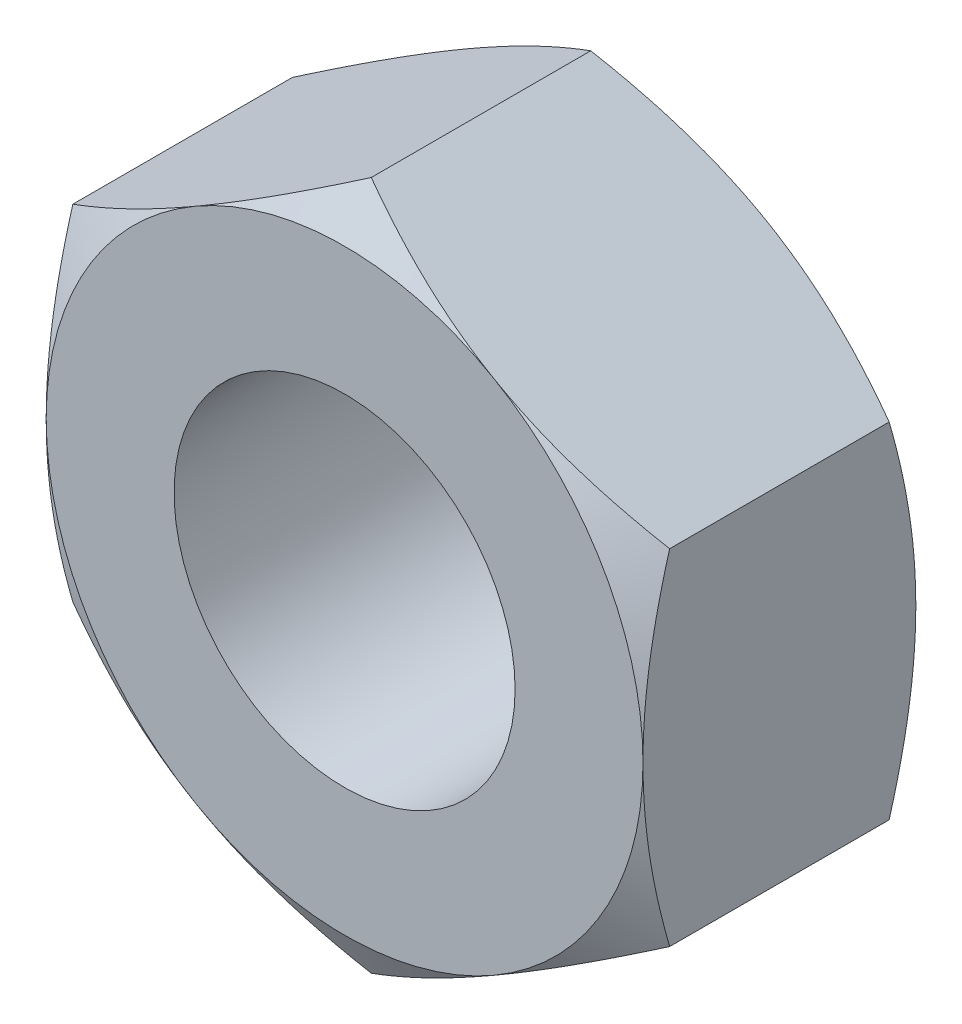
from build123d import *

# Parameters (mm, degrees)
BASE_EXTRUSION_DEPTH    = 3.2
ESQUISSE3_R             = 2
ENL_V_MAT_EXTRU_1_DEPTH = 7.23083729


with BuildPart() as part:
    # Esquisse1 → Base-Extrusion (new body)
    with BuildSketch(Plane.XY):
        Polygon((3.5, -2.020725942), (3.5, 2.020725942), (0, 4.041451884), (-3.5, 2.020725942), (-3.5, -2.020725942), (0, -4.041451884), align=None)
    extrude(amount=-BASE_EXTRUSION_DEPTH)

    # Esquisse2 → Enl_vement de mati_re-R_volution1 (revolve, cut)
    with BuildSketch(Plane(origin=(0, 0, 0), x_dir=(1, 0, 0), z_dir=(0, 1, 0))):
        Polygon((-3.5, 0), (-7.271281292, 0), (-7.271281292, 3.2), (-3.5, 3.2), (-6.271281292, 1.6), align=None)
    revolve(axis=Axis((0, 0, -3.2), (0, 0, 1)), mode=Mode.SUBTRACT)

    # Esquisse3 → Enl_v. mat.-Extru.1 (cut, through all)
    with BuildSketch(Plane.XY):
        Circle(ESQUISSE3_R)
    extrude(amount=-ENL_V_MAT_EXTRU_1_DEPTH, mode=Mode.SUBTRACT)


solid = part.part
